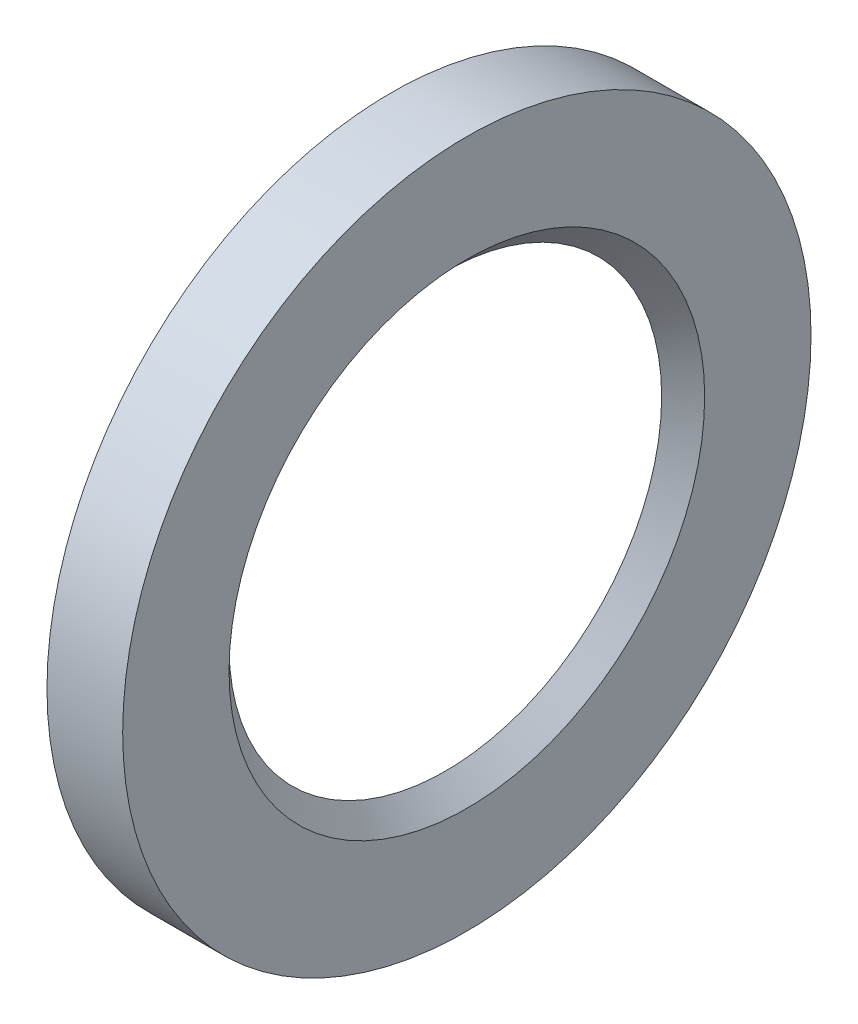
from build123d import *


with BuildPart() as part:
    # Sketch1 → Revolve1 (revolve)
    with BuildSketch(Plane.XY, mode=Mode.PRIVATE) as revolve1_sk:
        Polygon((0, 7.9819), (0, 11.2), (-2, 11.2), (-2, 12.7), (0.79375, 12.7), (0.79375, 8.77565), align=None)
    revolve(revolve1_sk.sketch.rotate(Axis((0, 0, 0), (1, 0, 0)), 90), axis=Axis((0, 0, 0), (1, 0, 0)))


solid = part.part
